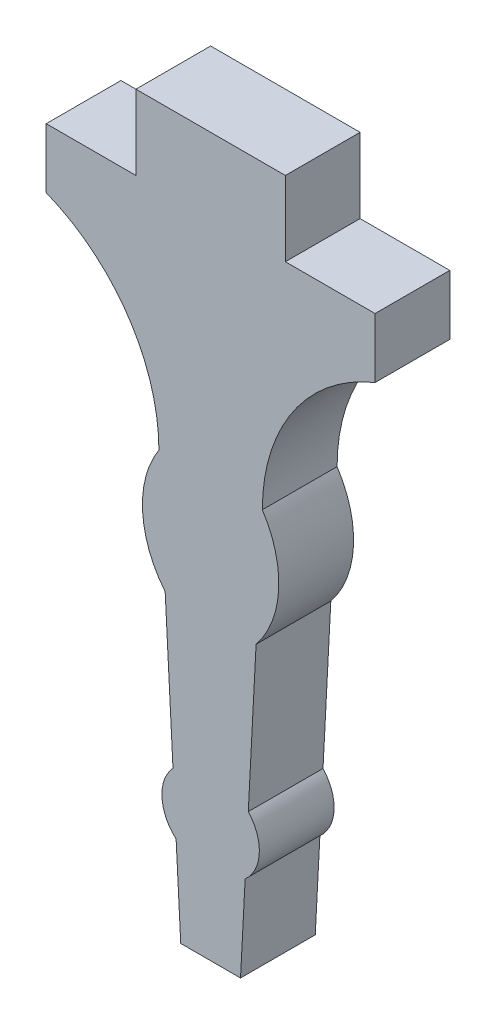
from build123d import *

# Parameters (mm, degrees)
BOSS_EXTRUDE1_DEPTH = 3.175


with BuildPart() as part:
    # Sketch1 → Boss-Extrude1 (new body)
    with BuildSketch(Plane.XY):
        with BuildLine():
            Line((3.175, 0), (-3.175, 0))
            Line((-3.175, 0), (-3.175, -3.175))
            Line((-3.175, -3.175), (-6.985, -3.175))
            Line((-6.985, -3.175), (-6.985, -5.715))
            ThreePointArc((-6.985, -5.715), (-3.506619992, -8.518098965), (-2.197138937, -12.789135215))
            ThreePointArc((-2.197138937, -12.789135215), (-2.891503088, -15.3725016), (-1.930907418, -17.869135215))
            Line((-1.930907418, -17.869135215), (-1.599381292, -24.195030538))
            ThreePointArc((-1.599381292, -24.195030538), (-2.067530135, -25.49305333), (-1.466265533, -26.735030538))
            Line((-1.466265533, -26.735030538), (-1.27, -30.48))
            Line((-1.27, -30.48), (1.27, -30.48))
            Line((1.27, -30.48), (1.466265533, -26.735030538))
            ThreePointArc((1.466265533, -26.735030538), (2.067530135, -25.49305333), (1.599381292, -24.195030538))
            Line((1.599381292, -24.195030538), (1.930907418, -17.869135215))
            ThreePointArc((1.930907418, -17.869135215), (2.891503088, -15.3725016), (2.197138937, -12.789135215))
            ThreePointArc((2.197138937, -12.789135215), (3.506619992, -8.518098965), (6.985, -5.715))
            Line((6.985, -5.715), (6.985, -3.175))
            Line((6.985, -3.175), (3.175, -3.175))
            Line((3.175, -3.175), (3.175, 0))
        make_face()
    extrude(amount=BOSS_EXTRUDE1_DEPTH)


solid = part.part
